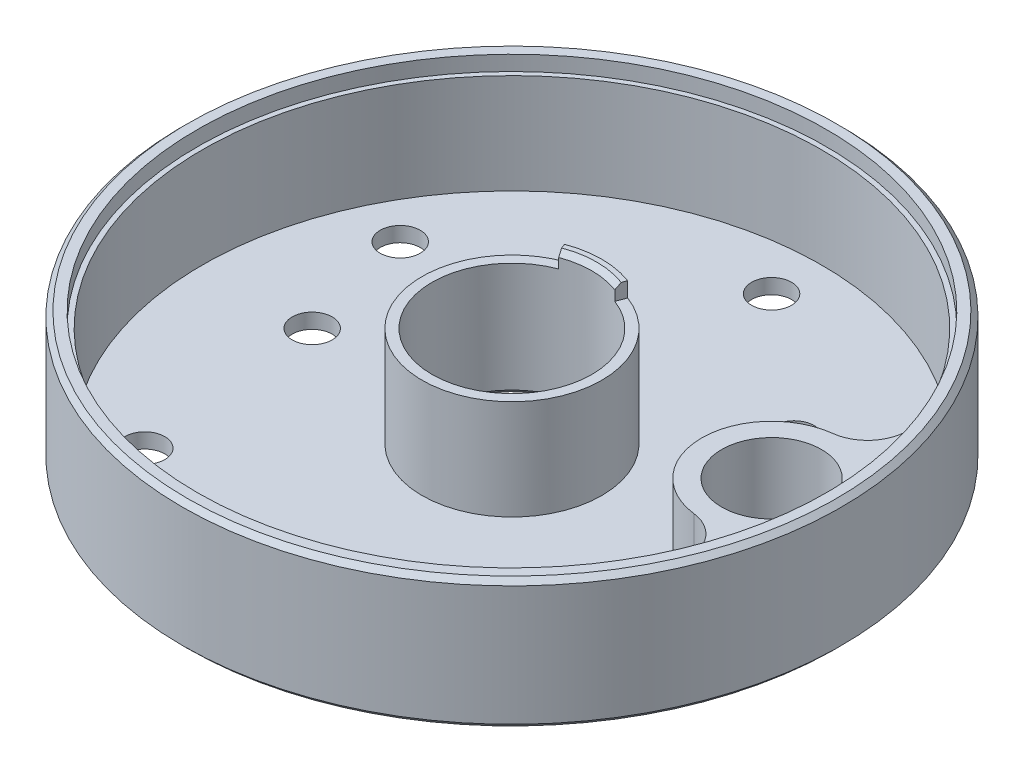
from build123d import *

# Parameters (mm, degrees)
SKETCH1_R           = 33
SKETCH1_R_2         = 8
BOSS_EXTRUDE1_DEPTH = 13
SKETCH2_R           = 31.5
CUT_EXTRUDE1_DEPTH  = 1.5
SKETCH3_R           = 5
CUT_EXTRUDE2_DEPTH  = 49.065060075
SKETCH4_R           = 9
CUT_EXTRUDE3_DEPTH  = 10
SKETCH5_R           = 2
SKETCH5_R_2         = 5
CUT_EXTRUDE4_DEPTH  = 49.065060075
CHAMFER1_SIZE       = 0.5
CHAMFER2_SIZE       = 0.5


with BuildPart() as part:
    # Sketch1 → Boss-Extrude1 (new body)
    with BuildSketch(Plane(origin=(0, 0, 0), x_dir=(1, 0, 0), z_dir=(0, 1, 0))):
        with Locations(Location((0, 0, 0), (0, 0, 270))):
            Circle(SKETCH1_R)
        with Locations(Location((0, 0, 0), (0, 0, 270))):
            Circle(SKETCH1_R_2, mode=Mode.SUBTRACT)
    extrude(amount=-BOSS_EXTRUDE1_DEPTH)

    # Sketch2 → Cut-Extrude1 (cut)
    with BuildSketch(Plane(origin=(0, 0, 0), x_dir=(1, 0, 0), z_dir=(0, 1, 0))):
        with Locations(Location((0, 0, 0), (0, 0, 270))):
            Circle(SKETCH2_R)
        with BuildLine():
            Line((2.808987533, 7.490633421), (3, 8))
            Line((3, 8), (3.160110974, 8.426962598))
            ThreePointArc((3.160110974, 8.426962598), (0, 9), (-3.160110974, 8.426962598))
            Line((-3.160110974, 8.426962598), (-3, 8))
            Line((-3, 8), (-2.808987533, 7.490633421))
            ThreePointArc((-2.808987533, 7.490633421), (0, -8), (2.808987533, 7.490633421))
        make_face(mode=Mode.SUBTRACT)
    extrude(amount=-CUT_EXTRUDE1_DEPTH, mode=Mode.SUBTRACT)

    # Sketch3 → Cut-Extrude2 (cut, through all)
    with BuildSketch(Plane(origin=(0, -1.5, 0), x_dir=(1, 0, 0), z_dir=(0, 1, 0))):
        with Locations(Location((26, 0, 0), (0, 0, 270))):
            Circle(SKETCH3_R)
    extrude(amount=-CUT_EXTRUDE2_DEPTH, mode=Mode.SUBTRACT)

    # Sketch4 → Cut-Extrude3 (cut)
    with BuildSketch(Plane(origin=(0, -1.5, 0), x_dir=(1, 0, 0), z_dir=(0, 1, 0))):
        with BuildLine():
            ThreePointArc((28.35042735, 12.540066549), (-31, 0), (28.35042735, -12.540066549))
            ThreePointArc((28.35042735, -12.540066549), (28.168362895, -8.942842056), (25.167832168, -6.950359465))
            ThreePointArc((25.167832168, -6.950359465), (19, 0), (25.167832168, 6.950359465))
            ThreePointArc((25.167832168, 6.950359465), (28.168362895, 8.942842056), (28.35042735, 12.540066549))
        make_face()
        with Locations(Location((0, 0, 0), (0, 0, 270))):
            Circle(SKETCH4_R, mode=Mode.SUBTRACT)
    extrude(amount=-CUT_EXTRUDE3_DEPTH, mode=Mode.SUBTRACT)

    # Sketch5 → Cut-Extrude4 (cut, through all)
    with BuildSketch(Plane(origin=(0, -11.5, 0), x_dir=(1, 0, 0), z_dir=(0, 1, 0))):
        with Locations(Location((0, 26, 0), (0, 0, 270))):
            Circle(SKETCH5_R)
        with Locations(Location((-20, 0, 0), (0, 0, 270))):
            Circle(SKETCH5_R)
        with Locations(Location((5.56220042, -19.210984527, 0), (0, 0, 270))):
            Circle(SKETCH5_R)
        with Locations(Location((-18, -18.761663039, 0), (0, 0, 270))):
            Circle(SKETCH5_R)
        with Locations(Location((18, -18.761663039, 0), (0, 0, 270))):
            Circle(SKETCH5_R)
        with Locations(Location((13.551346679, 14.709214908, 0), (0, 0, 270))):
            Circle(SKETCH5_R)
        with Locations(Location((-9.878182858, 9.920761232, 0), (0, 0, 270))):
            Circle(SKETCH5_R_2)
        with Locations(Location((-23.106177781, 11.920761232, 0), (0, 0, 270))):
            Circle(SKETCH5_R)
    extrude(amount=-CUT_EXTRUDE4_DEPTH, mode=Mode.SUBTRACT)

    # Chamfer1
    chamfer1_edges = [part.edges().sort_by_distance(p)[0] for p in [
        (0, 0, -33),
        (0, -13, -33),
        (0, 0, -8),
    ]]
    chamfer(chamfer1_edges, length=CHAMFER1_SIZE)

    # Chamfer2
    chamfer2_edges = [part.edges().sort_by_distance(p)[0] for p in [
        (0, -13, -8),
    ]]
    chamfer(chamfer2_edges, length=CHAMFER2_SIZE)


solid = part.part
